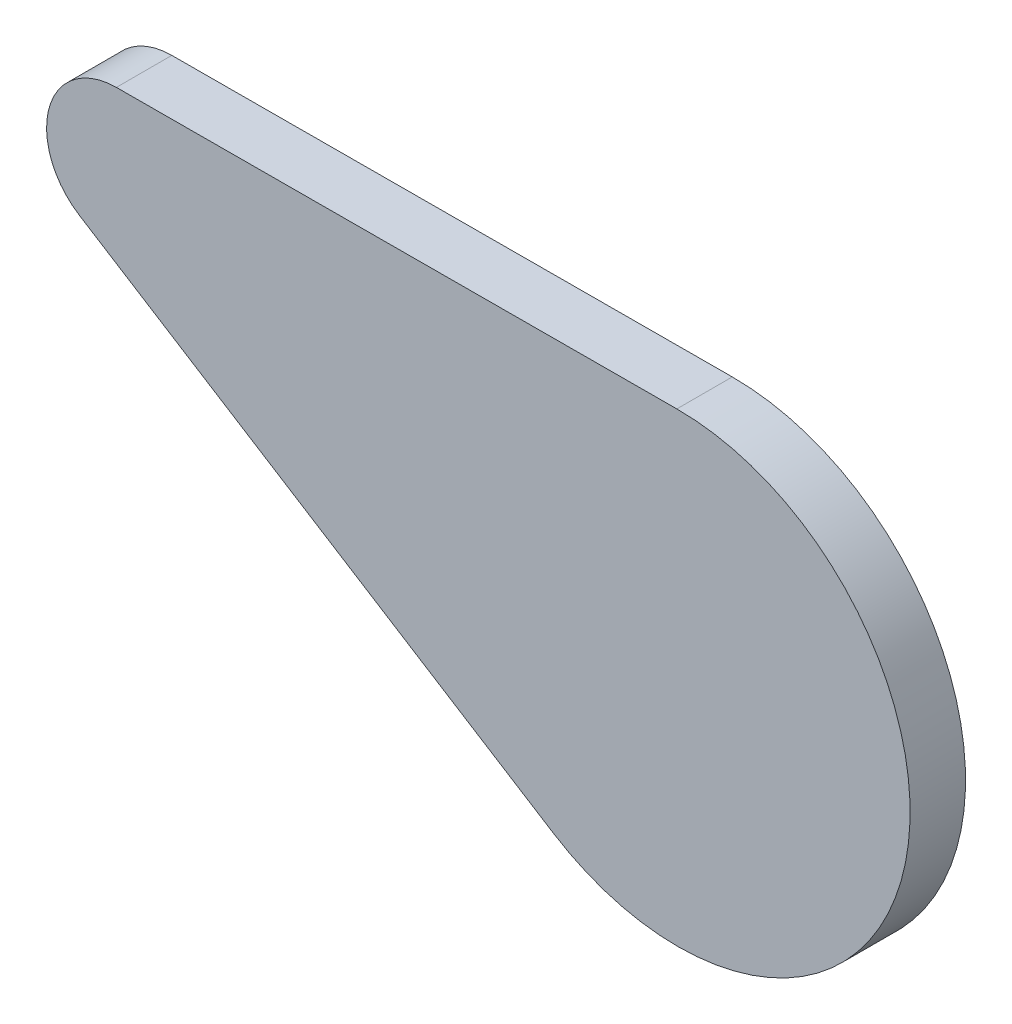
ISO-10303-21;
HEADER;
FILE_DESCRIPTION(('STEP AP214'),'2;1');
FILE_NAME('part.step','',(''),(''),'','','');
FILE_SCHEMA(('AUTOMOTIVE_DESIGN { 1 0 10303 214 1 1 1 1 }'));
ENDSEC;
DATA;
#1=APPLICATION_CONTEXT('core data for automotive mechanical design processes');
#2=APPLICATION_PROTOCOL_DEFINITION('international standard','automotive_design',2000,#1);
#3=PRODUCT_CONTEXT('',#1,'mechanical');
#4=PRODUCT('Part','Part','',(#3));
#5=PRODUCT_RELATED_PRODUCT_CATEGORY('part','',(#4));
#6=PRODUCT_DEFINITION_FORMATION('','',#4);
#7=PRODUCT_DEFINITION_CONTEXT('part definition',#1,'design');
#8=PRODUCT_DEFINITION('design','',#6,#7);
#9=PRODUCT_DEFINITION_SHAPE('','',#8);
#10=(LENGTH_UNIT() NAMED_UNIT(*) SI_UNIT(.MILLI.,.METRE.));
#11=(NAMED_UNIT(*) PLANE_ANGLE_UNIT() SI_UNIT($,.RADIAN.));
#12=(NAMED_UNIT(*) SI_UNIT($,.STERADIAN.) SOLID_ANGLE_UNIT());
#13=UNCERTAINTY_MEASURE_WITH_UNIT(LENGTH_MEASURE(1.E-05),#10,'distance_accuracy_value','');
#14=(GEOMETRIC_REPRESENTATION_CONTEXT(3) GLOBAL_UNCERTAINTY_ASSIGNED_CONTEXT((#13)) GLOBAL_UNIT_ASSIGNED_CONTEXT((#10,
#11,#12)) REPRESENTATION_CONTEXT('',''));
#15=CARTESIAN_POINT('',(0.,0.,0.));
#16=DIRECTION('',(0.,0.,1.));
#17=DIRECTION('',(1.,0.,0.));
#18=AXIS2_PLACEMENT_3D('',#15,#16,#17);
#19=CARTESIAN_POINT('',(0.,0.,-10.));
#20=DIRECTION('',(0.,0.,1.));
#21=DIRECTION('',(1.,0.,0.));
#22=AXIS2_PLACEMENT_3D('',#19,#20,#21);
#23=CYLINDRICAL_SURFACE('',#22,41.9519666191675);
#24=CARTESIAN_POINT('',(0.,0.,0.));
#25=DIRECTION('',(0.,0.,1.));
#26=DIRECTION('',(-1.,0.,0.));
#27=AXIS2_PLACEMENT_3D('',#24,#25,#26);
#28=CIRCLE('',#27,41.9519666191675);
#29=CARTESIAN_POINT('',(-22.3328856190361,-35.5135146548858,0.));
#30=VERTEX_POINT('',#29);
#31=CARTESIAN_POINT('',(-0.1324902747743,41.9517574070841,0.));
#32=VERTEX_POINT('',#31);
#33=EDGE_CURVE('E96',#30,#32,#28,.T.);
#34=ORIENTED_EDGE('',*,*,#33,.F.);
#35=DIRECTION('',(0.,0.,1.));
#36=VECTOR('',#35,1.);
#37=CARTESIAN_POINT('',(-22.3328856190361,-35.5135146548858,-10.));
#38=LINE('',#37,#36);
#39=CARTESIAN_POINT('',(-22.3328856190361,-35.5135146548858,-10.));
#40=VERTEX_POINT('',#39);
#41=EDGE_CURVE('E11',#40,#30,#38,.T.);
#42=ORIENTED_EDGE('',*,*,#41,.F.);
#43=CARTESIAN_POINT('',(0.,0.,-10.));
#44=DIRECTION('',(0.,0.,1.));
#45=DIRECTION('',(-1.,0.,0.));
#46=AXIS2_PLACEMENT_3D('',#43,#44,#45);
#47=CIRCLE('',#46,41.9519666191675);
#48=CARTESIAN_POINT('',(-0.1324902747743,41.9517574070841,-10.));
#49=VERTEX_POINT('',#48);
#50=EDGE_CURVE('E90',#40,#49,#47,.T.);
#51=ORIENTED_EDGE('',*,*,#50,.T.);
#52=DIRECTION('',(0.,0.,1.));
#53=VECTOR('',#52,1.);
#54=CARTESIAN_POINT('',(-0.1324902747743,41.9517574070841,-10.));
#55=LINE('',#54,#53);
#56=EDGE_CURVE('E35',#49,#32,#55,.T.);
#57=ORIENTED_EDGE('',*,*,#56,.T.);
#58=EDGE_LOOP('',(#34,#42,#51,#57));
#59=FACE_BOUND('',#58,.T.);
#60=ADVANCED_FACE('F32',(#59),#23,.T.);
#61=CARTESIAN_POINT('',(-22.3328856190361,-35.5135146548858,-10.));
#62=DIRECTION('',(-0.532344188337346,-0.846528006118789,0.));
#63=DIRECTION('',(0.846528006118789,-0.532344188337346,0.));
#64=AXIS2_PLACEMENT_3D('',#61,#62,#63);
#65=PLANE('',#64);
#66=DIRECTION('',(0.846528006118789,-0.532344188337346,0.));
#67=VECTOR('',#66,1.);
#68=CARTESIAN_POINT('',(-22.3328856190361,-35.5135146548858,0.));
#69=LINE('',#68,#67);
#70=CARTESIAN_POINT('',(-107.924267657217,18.3111367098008,0.));
#71=VERTEX_POINT('',#70);
#72=EDGE_CURVE('E92',#71,#30,#69,.T.);
#73=ORIENTED_EDGE('',*,*,#72,.F.);
#74=DIRECTION('',(0.,0.,1.));
#75=VECTOR('',#74,1.);
#76=CARTESIAN_POINT('',(-107.924267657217,18.3111367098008,-10.));
#77=LINE('',#76,#75);
#78=CARTESIAN_POINT('',(-107.924267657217,18.3111367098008,-10.));
#79=VERTEX_POINT('',#78);
#80=EDGE_CURVE('E41',#79,#71,#77,.T.);
#81=ORIENTED_EDGE('',*,*,#80,.F.);
#82=DIRECTION('',(0.846528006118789,-0.532344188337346,0.));
#83=VECTOR('',#82,1.);
#84=CARTESIAN_POINT('',(-22.3328856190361,-35.5135146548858,-10.));
#85=LINE('',#84,#83);
#86=EDGE_CURVE('E87',#79,#40,#85,.T.);
#87=ORIENTED_EDGE('',*,*,#86,.T.);
#88=ORIENTED_EDGE('',*,*,#41,.T.);
#89=EDGE_LOOP('',(#73,#81,#87,#88));
#90=FACE_BOUND('',#89,.T.);
#91=ADVANCED_FACE('F106',(#90),#65,.T.);
#92=CARTESIAN_POINT('',(-101.200841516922,29.0026566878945,-10.));
#93=DIRECTION('',(0.,0.,1.));
#94=DIRECTION('',(1.,0.,0.));
#95=AXIS2_PLACEMENT_3D('',#92,#93,#94);
#96=CYLINDRICAL_SURFACE('',#95,12.6298479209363);
#97=CARTESIAN_POINT('',(-101.200841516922,29.0026566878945,0.));
#98=DIRECTION('',(0.,0.,1.));
#99=DIRECTION('',(-1.,0.,0.));
#100=AXIS2_PLACEMENT_3D('',#97,#98,#99);
#101=CIRCLE('',#100,12.6298479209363);
#102=CARTESIAN_POINT('',(-101.240728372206,41.6324416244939,0.));
#103=VERTEX_POINT('',#102);
#104=EDGE_CURVE('E82',#103,#71,#101,.T.);
#105=ORIENTED_EDGE('',*,*,#104,.F.);
#106=DIRECTION('',(0.,0.,1.));
#107=VECTOR('',#106,1.);
#108=CARTESIAN_POINT('',(-101.240728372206,41.6324416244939,-10.));
#109=LINE('',#108,#107);
#110=CARTESIAN_POINT('',(-101.240728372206,41.6324416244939,-10.));
#111=VERTEX_POINT('',#110);
#112=EDGE_CURVE('E77',#111,#103,#109,.T.);
#113=ORIENTED_EDGE('',*,*,#112,.F.);
#114=CARTESIAN_POINT('',(-101.200841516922,29.0026566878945,-10.));
#115=DIRECTION('',(0.,0.,1.));
#116=DIRECTION('',(-1.,0.,0.));
#117=AXIS2_PLACEMENT_3D('',#114,#115,#116);
#118=CIRCLE('',#117,12.6298479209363);
#119=EDGE_CURVE('E80',#111,#79,#118,.T.);
#120=ORIENTED_EDGE('',*,*,#119,.T.);
#121=ORIENTED_EDGE('',*,*,#80,.T.);
#122=EDGE_LOOP('',(#105,#113,#120,#121));
#123=FACE_BOUND('',#122,.T.);
#124=ADVANCED_FACE('F79',(#123),#96,.T.);
#125=CARTESIAN_POINT('',(-101.240728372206,41.6324416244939,-10.));
#126=DIRECTION('',(-0.00315814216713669,0.999995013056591,0.));
#127=DIRECTION('',(-0.999995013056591,-0.00315814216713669,0.));
#128=AXIS2_PLACEMENT_3D('',#125,#126,#127);
#129=PLANE('',#128);
#130=DIRECTION('',(-0.999995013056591,-0.00315814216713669,0.));
#131=VECTOR('',#130,1.);
#132=CARTESIAN_POINT('',(-101.240728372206,41.6324416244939,0.));
#133=LINE('',#132,#131);
#134=EDGE_CURVE('E99',#32,#103,#133,.T.);
#135=ORIENTED_EDGE('',*,*,#134,.F.);
#136=ORIENTED_EDGE('',*,*,#56,.F.);
#137=DIRECTION('',(-0.999995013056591,-0.00315814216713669,0.));
#138=VECTOR('',#137,1.);
#139=CARTESIAN_POINT('',(-101.240728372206,41.6324416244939,-10.));
#140=LINE('',#139,#138);
#141=EDGE_CURVE('E86',#49,#111,#140,.T.);
#142=ORIENTED_EDGE('',*,*,#141,.T.);
#143=ORIENTED_EDGE('',*,*,#112,.T.);
#144=EDGE_LOOP('',(#135,#136,#142,#143));
#145=FACE_BOUND('',#144,.T.);
#146=ADVANCED_FACE('F89',(#145),#129,.T.);
#147=CARTESIAN_POINT('',(0.,0.,-10.));
#148=DIRECTION('',(0.,0.,-1.));
#149=DIRECTION('',(-1.,0.,0.));
#150=AXIS2_PLACEMENT_3D('',#147,#148,#149);
#151=PLANE('',#150);
#152=ORIENTED_EDGE('',*,*,#50,.F.);
#153=ORIENTED_EDGE('',*,*,#86,.F.);
#154=ORIENTED_EDGE('',*,*,#119,.F.);
#155=ORIENTED_EDGE('',*,*,#141,.F.);
#156=EDGE_LOOP('',(#152,#153,#154,#155));
#157=FACE_BOUND('',#156,.T.);
#158=ADVANCED_FACE('F85',(#157),#151,.T.);
#159=CARTESIAN_POINT('',(0.,0.,0.));
#160=DIRECTION('',(0.,0.,-1.));
#161=DIRECTION('',(-1.,0.,0.));
#162=AXIS2_PLACEMENT_3D('',#159,#160,#161);
#163=PLANE('',#162);
#164=ORIENTED_EDGE('',*,*,#33,.T.);
#165=ORIENTED_EDGE('',*,*,#134,.T.);
#166=ORIENTED_EDGE('',*,*,#104,.T.);
#167=ORIENTED_EDGE('',*,*,#72,.T.);
#168=EDGE_LOOP('',(#164,#165,#166,#167));
#169=FACE_BOUND('',#168,.T.);
#170=ADVANCED_FACE('F105',(#169),#163,.F.);
#171=CLOSED_SHELL('',(#60,#91,#124,#146,#158,#170));
#172=MANIFOLD_SOLID_BREP('B2',#171);
#173=ADVANCED_BREP_SHAPE_REPRESENTATION('',(#18,#172),#14);
#174=SHAPE_DEFINITION_REPRESENTATION(#9,#173);
ENDSEC;
END-ISO-10303-21;
